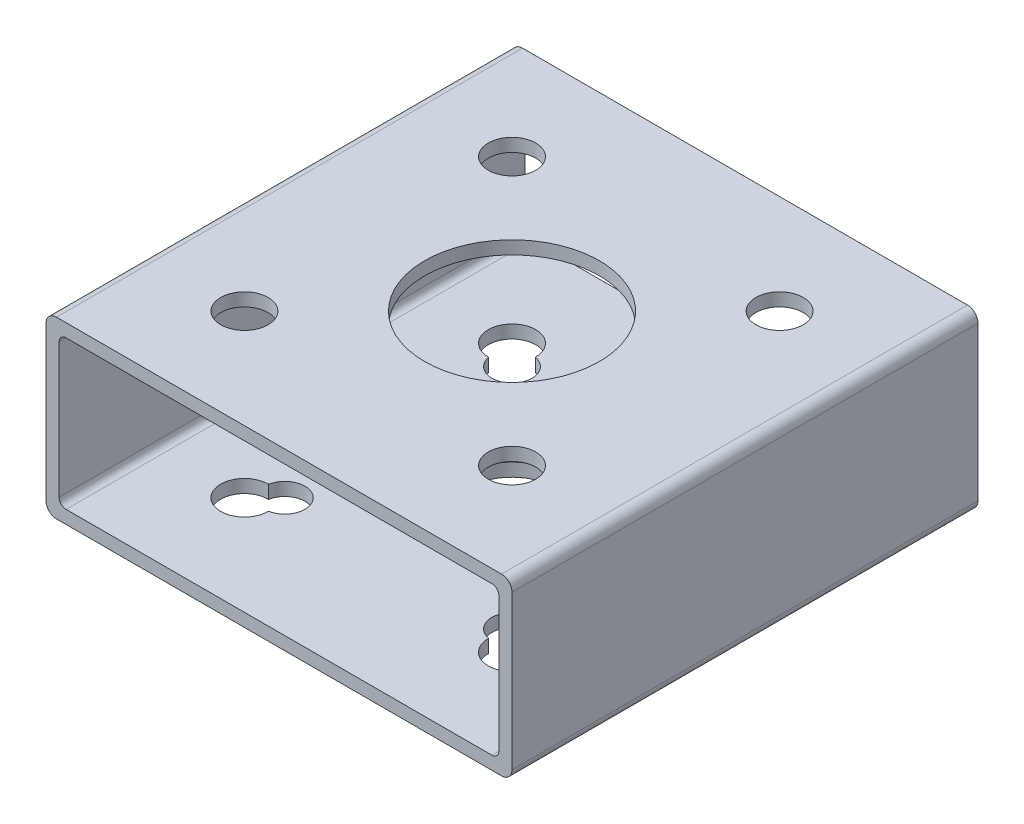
from build123d import *

# Parameters (mm, degrees)
SKETCH1_W               = 203.2
SKETCH1_H               = 76.2
SKETCH1_W_2             = 191.77
SKETCH1_H_2             = 64.77
BASE_EXTRUDE_THIN_DEPTH = 203.2
FILLET2_R               = 3.048
FILLET3_R               = 4.572
SKETCH2_R               = 38.1
SKETCH2_R_2             = 10.3251
ACTUATOR_DEPTH          = 5.715
SKETCH6_R               = 19.05
SKETCH6_R_2             = 8.763
BF_VALVE_DEPTH          = 5.715
ACT_START               = -5.715
SKETCH7_R               = 10.3251
ACT_BOLT_ACCESS_DEPTH   = 5.715


with BuildPart() as part:
    # Sketch1 → Base-Extrude-Thin (new body)
    with BuildSketch(Plane.XY):
        with Locations((101.6, 38.1)):
            Rectangle(SKETCH1_W, SKETCH1_H)
        with Locations((101.6, 38.1)):
            Rectangle(SKETCH1_W_2, SKETCH1_H_2, mode=Mode.SUBTRACT)
    extrude(amount=-BASE_EXTRUDE_THIN_DEPTH)

    # Fillet2
    fillet2_edges = [part.edges().sort_by_distance(p)[0] for p in [
        (197.485, 5.715, -101.6),
        (5.715, 5.715, -101.6),
        (5.715, 70.485, -101.6),
        (197.485, 70.485, -101.6),
    ]]
    fillet(fillet2_edges, radius=FILLET2_R)

    # Fillet3
    fillet3_edges = [part.edges().sort_by_distance(p)[0] for p in [
        (0, 0, -101.6),
        (0, 76.2, -101.6),
        (203.2, 76.2, -101.6),
        (203.2, 0, -101.6),
    ]]
    fillet(fillet3_edges, radius=FILLET3_R)

    # Sketch2 → ACTUATOR (cut)
    with BuildSketch(Plane(origin=(0, 76.2, 0), x_dir=(-1, 0, 0), z_dir=(0, 1, 0))):
        with Locations(Location((-101.6, -101.6, 0), (0, 0, 90))):
            Circle(SKETCH2_R)
        with Locations(Location((-159.936309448, -159.936309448, 0), (0, 0, 90))):
            Circle(SKETCH2_R_2)
        with Locations(Location((-43.263690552, -159.936309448, 0), (0, 0, 270))):
            Circle(SKETCH2_R_2)
        with Locations(Location((-159.936309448, -43.263690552, 0), (0, 0, 90))):
            Circle(SKETCH2_R_2)
        with Locations(Location((-43.263690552, -43.263690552, 0), (0, 0, 270))):
            Circle(SKETCH2_R_2)
    extrude(amount=-ACTUATOR_DEPTH, mode=Mode.SUBTRACT)

    # Sketch6 → BF VALVE (cut)
    with BuildSketch(Plane.XZ):
        with Locations((101.6, -101.6)):
            Circle(SKETCH6_R)
        with Locations((52.07, -52.07)):
            Circle(SKETCH6_R_2)
        with Locations((52.07, -151.13)):
            Circle(SKETCH6_R_2)
        with Locations((151.13, -52.07)):
            Circle(SKETCH6_R_2)
        with Locations((151.13, -151.13)):
            Circle(SKETCH6_R_2)
    extrude(amount=-BF_VALVE_DEPTH, mode=Mode.SUBTRACT)

    # Sketch7 → ACT BOLT ACCESS (cut)
    with BuildSketch(Plane.XZ.offset(ACT_START)):
        with Locations(Location((43.263690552, -159.936309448, 0), (0, 0, 270))):
            Circle(SKETCH7_R)
        with Locations(Location((159.936309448, -159.936309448, 0), (0, 0, 90))):
            Circle(SKETCH7_R)
        with Locations(Location((159.936309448, -43.263690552, 0), (0, 0, 90))):
            Circle(SKETCH7_R)
        with Locations(Location((43.263690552, -43.263690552, 0), (0, 0, 270))):
            Circle(SKETCH7_R)
    extrude(amount=ACT_BOLT_ACCESS_DEPTH, mode=Mode.SUBTRACT)


solid = part.part
